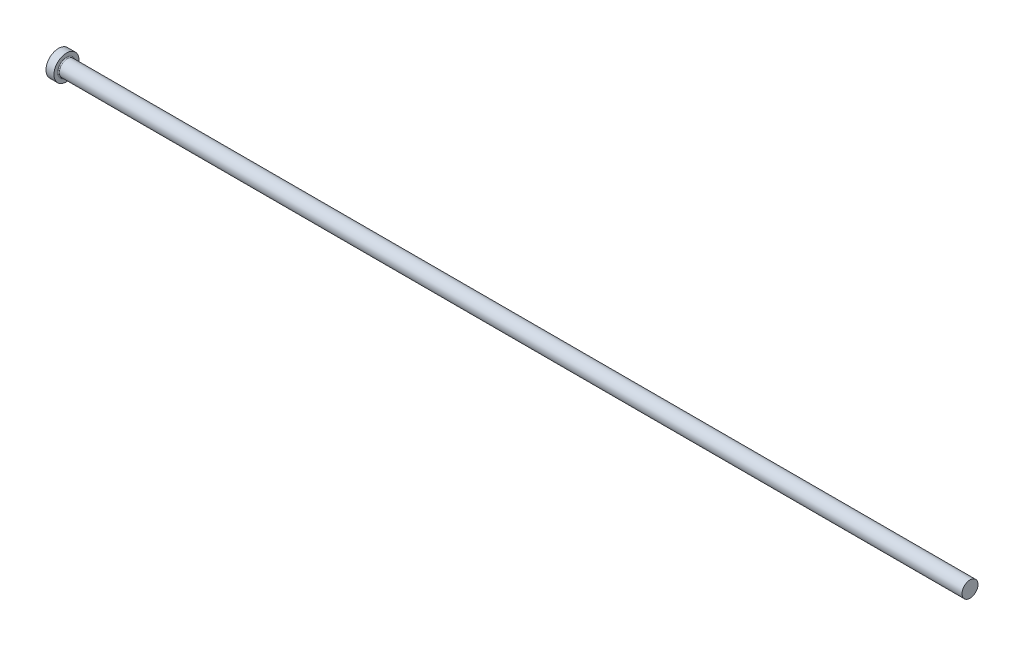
ISO-10303-21;
HEADER;
FILE_DESCRIPTION(('STEP AP214'),'2;1');
FILE_NAME('part.step','',(''),(''),'','','');
FILE_SCHEMA(('AUTOMOTIVE_DESIGN { 1 0 10303 214 1 1 1 1 }'));
ENDSEC;
DATA;
#1=APPLICATION_CONTEXT('core data for automotive mechanical design processes');
#2=APPLICATION_PROTOCOL_DEFINITION('international standard','automotive_design',2000,#1);
#3=PRODUCT_CONTEXT('',#1,'mechanical');
#4=PRODUCT('Part','Part','',(#3));
#5=PRODUCT_RELATED_PRODUCT_CATEGORY('part','',(#4));
#6=PRODUCT_DEFINITION_FORMATION('','',#4);
#7=PRODUCT_DEFINITION_CONTEXT('part definition',#1,'design');
#8=PRODUCT_DEFINITION('design','',#6,#7);
#9=PRODUCT_DEFINITION_SHAPE('','',#8);
#10=(LENGTH_UNIT() NAMED_UNIT(*) SI_UNIT(.MILLI.,.METRE.));
#11=(NAMED_UNIT(*) PLANE_ANGLE_UNIT() SI_UNIT($,.RADIAN.));
#12=(NAMED_UNIT(*) SI_UNIT($,.STERADIAN.) SOLID_ANGLE_UNIT());
#13=UNCERTAINTY_MEASURE_WITH_UNIT(LENGTH_MEASURE(1.E-05),#10,'distance_accuracy_value','');
#14=(GEOMETRIC_REPRESENTATION_CONTEXT(3) GLOBAL_UNCERTAINTY_ASSIGNED_CONTEXT((#13)) GLOBAL_UNIT_ASSIGNED_CONTEXT((#10,
#11,#12)) REPRESENTATION_CONTEXT('',''));
#15=CARTESIAN_POINT('',(0.,0.,0.));
#16=DIRECTION('',(0.,0.,1.));
#17=DIRECTION('',(1.,0.,0.));
#18=AXIS2_PLACEMENT_3D('',#15,#16,#17);
#19=CARTESIAN_POINT('',(0.,0.,0.));
#20=DIRECTION('',(-1.,0.,0.));
#21=DIRECTION('',(0.,-1.,0.));
#22=AXIS2_PLACEMENT_3D('',#19,#20,#21);
#23=PLANE('',#22);
#24=CARTESIAN_POINT('',(0.,0.,0.));
#25=DIRECTION('',(1.,0.,0.));
#26=DIRECTION('',(0.,1.,0.));
#27=AXIS2_PLACEMENT_3D('',#24,#25,#26);
#28=CIRCLE('',#27,11.);
#29=CARTESIAN_POINT('',(0.,11.,0.));
#30=VERTEX_POINT('',#29);
#31=EDGE_CURVE('E25',#30,#30,#28,.T.);
#32=ORIENTED_EDGE('',*,*,#31,.F.);
#33=EDGE_LOOP('',(#32));
#34=FACE_BOUND('',#33,.T.);
#35=ADVANCED_FACE('F14',(#34),#23,.T.);
#36=CARTESIAN_POINT('',(800.,0.,0.));
#37=DIRECTION('',(1.,0.,0.));
#38=DIRECTION('',(0.,1.,0.));
#39=AXIS2_PLACEMENT_3D('',#36,#37,#38);
#40=CYLINDRICAL_SURFACE('',#39,11.);
#41=ORIENTED_EDGE('',*,*,#31,.T.);
#42=EDGE_LOOP('',(#41));
#43=FACE_BOUND('',#42,.T.);
#44=CARTESIAN_POINT('',(7.,0.,0.));
#45=DIRECTION('',(1.,0.,0.));
#46=DIRECTION('',(0.,1.,0.));
#47=AXIS2_PLACEMENT_3D('',#44,#45,#46);
#48=CIRCLE('',#47,11.);
#49=CARTESIAN_POINT('',(7.,11.,0.));
#50=VERTEX_POINT('',#49);
#51=EDGE_CURVE('E29',#50,#50,#48,.T.);
#52=ORIENTED_EDGE('',*,*,#51,.F.);
#53=EDGE_LOOP('',(#52));
#54=FACE_BOUND('',#53,.T.);
#55=ADVANCED_FACE('F51',(#43,#54),#40,.T.);
#56=CARTESIAN_POINT('',(7.,11.,0.));
#57=DIRECTION('',(1.,0.,0.));
#58=DIRECTION('',(0.,1.,0.));
#59=AXIS2_PLACEMENT_3D('',#56,#57,#58);
#60=PLANE('',#59);
#61=CARTESIAN_POINT('',(7.,0.,0.));
#62=DIRECTION('',(1.,0.,0.));
#63=DIRECTION('',(0.,1.,0.));
#64=AXIS2_PLACEMENT_3D('',#61,#62,#63);
#65=CIRCLE('',#64,7.7999999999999);
#66=CARTESIAN_POINT('',(7.,7.7999999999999,0.));
#67=VERTEX_POINT('',#66);
#68=EDGE_CURVE('E9',#67,#67,#65,.F.);
#69=ORIENTED_EDGE('',*,*,#68,.T.);
#70=EDGE_LOOP('',(#69));
#71=FACE_BOUND('',#70,.T.);
#72=ORIENTED_EDGE('',*,*,#51,.T.);
#73=EDGE_LOOP('',(#72));
#74=FACE_BOUND('',#73,.T.);
#75=ADVANCED_FACE('F42',(#71,#74),#60,.T.);
#76=CARTESIAN_POINT('',(800.,0.,0.));
#77=DIRECTION('',(1.,0.,0.));
#78=DIRECTION('',(0.,1.,0.));
#79=AXIS2_PLACEMENT_3D('',#76,#77,#78);
#80=CYLINDRICAL_SURFACE('',#79,6.9999999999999);
#81=CARTESIAN_POINT('',(7.8,0.,0.));
#82=DIRECTION('',(1.,0.,0.));
#83=DIRECTION('',(0.,1.,0.));
#84=AXIS2_PLACEMENT_3D('',#81,#82,#83);
#85=CIRCLE('',#84,6.9999999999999);
#86=CARTESIAN_POINT('',(7.8,6.9999999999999,0.));
#87=VERTEX_POINT('',#86);
#88=EDGE_CURVE('E21',#87,#87,#85,.T.);
#89=ORIENTED_EDGE('',*,*,#88,.T.);
#90=EDGE_LOOP('',(#89));
#91=FACE_BOUND('',#90,.T.);
#92=CARTESIAN_POINT('',(800.,0.,0.));
#93=DIRECTION('',(1.,0.,0.));
#94=DIRECTION('',(0.,1.,0.));
#95=AXIS2_PLACEMENT_3D('',#92,#93,#94);
#96=CIRCLE('',#95,6.9999999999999);
#97=CARTESIAN_POINT('',(800.,6.99999999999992,0.));
#98=VERTEX_POINT('',#97);
#99=EDGE_CURVE('E34',#98,#98,#96,.T.);
#100=ORIENTED_EDGE('',*,*,#99,.F.);
#101=EDGE_LOOP('',(#100));
#102=FACE_BOUND('',#101,.T.);
#103=ADVANCED_FACE('F40',(#91,#102),#80,.T.);
#104=CARTESIAN_POINT('',(800.,6.99999999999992,0.));
#105=DIRECTION('',(1.,0.,0.));
#106=DIRECTION('',(0.,1.,0.));
#107=AXIS2_PLACEMENT_3D('',#104,#105,#106);
#108=PLANE('',#107);
#109=ORIENTED_EDGE('',*,*,#99,.T.);
#110=EDGE_LOOP('',(#109));
#111=FACE_BOUND('',#110,.T.);
#112=ADVANCED_FACE('F38',(#111),#108,.T.);
#113=CARTESIAN_POINT('',(7.8,0.,0.));
#114=DIRECTION('',(1.,0.,0.));
#115=DIRECTION('',(0.,1.,0.));
#116=AXIS2_PLACEMENT_3D('',#113,#114,#115);
#117=TOROIDAL_SURFACE('',#116,7.7999999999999,0.8);
#118=ORIENTED_EDGE('',*,*,#68,.F.);
#119=EDGE_LOOP('',(#118));
#120=FACE_BOUND('',#119,.T.);
#121=ORIENTED_EDGE('',*,*,#88,.F.);
#122=EDGE_LOOP('',(#121));
#123=FACE_BOUND('',#122,.T.);
#124=ADVANCED_FACE('F16',(#120,#123),#117,.F.);
#125=CLOSED_SHELL('',(#35,#55,#75,#103,#112,#124));
#126=MANIFOLD_SOLID_BREP('B1',#125);
#127=ADVANCED_BREP_SHAPE_REPRESENTATION('',(#18,#126),#14);
#128=SHAPE_DEFINITION_REPRESENTATION(#9,#127);
ENDSEC;
END-ISO-10303-21;
